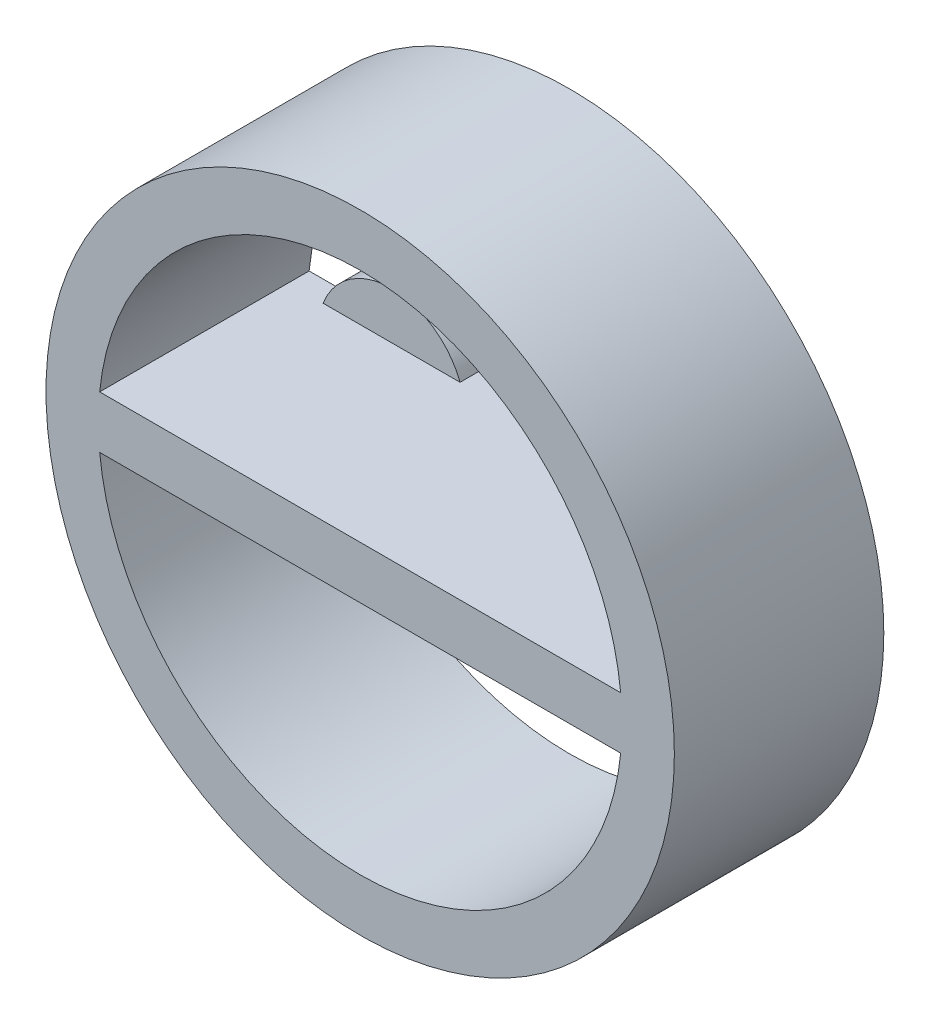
ISO-10303-21;
HEADER;
FILE_DESCRIPTION(('STEP AP214'),'2;1');
FILE_NAME('part.step','',(''),(''),'','','');
FILE_SCHEMA(('AUTOMOTIVE_DESIGN { 1 0 10303 214 1 1 1 1 }'));
ENDSEC;
DATA;
#1=APPLICATION_CONTEXT('core data for automotive mechanical design processes');
#2=APPLICATION_PROTOCOL_DEFINITION('international standard','automotive_design',2000,#1);
#3=PRODUCT_CONTEXT('',#1,'mechanical');
#4=PRODUCT('Part','Part','',(#3));
#5=PRODUCT_RELATED_PRODUCT_CATEGORY('part','',(#4));
#6=PRODUCT_DEFINITION_FORMATION('','',#4);
#7=PRODUCT_DEFINITION_CONTEXT('part definition',#1,'design');
#8=PRODUCT_DEFINITION('design','',#6,#7);
#9=PRODUCT_DEFINITION_SHAPE('','',#8);
#10=(LENGTH_UNIT() NAMED_UNIT(*) SI_UNIT(.MILLI.,.METRE.));
#11=(NAMED_UNIT(*) PLANE_ANGLE_UNIT() SI_UNIT($,.RADIAN.));
#12=(NAMED_UNIT(*) SI_UNIT($,.STERADIAN.) SOLID_ANGLE_UNIT());
#13=UNCERTAINTY_MEASURE_WITH_UNIT(LENGTH_MEASURE(1.E-05),#10,'distance_accuracy_value','');
#14=(GEOMETRIC_REPRESENTATION_CONTEXT(3) GLOBAL_UNCERTAINTY_ASSIGNED_CONTEXT((#13)) GLOBAL_UNIT_ASSIGNED_CONTEXT((#10,
#11,#12)) REPRESENTATION_CONTEXT('',''));
#15=CARTESIAN_POINT('',(0.,0.,0.));
#16=DIRECTION('',(0.,0.,1.));
#17=DIRECTION('',(1.,0.,0.));
#18=AXIS2_PLACEMENT_3D('',#15,#16,#17);
#19=CARTESIAN_POINT('',(-2.75,0.25,2.));
#20=DIRECTION('',(0.,-1.,0.));
#21=DIRECTION('',(0.,0.,-1.));
#22=AXIS2_PLACEMENT_3D('',#19,#20,#21);
#23=PLANE('',#22);
#24=DIRECTION('',(0.,0.,-1.));
#25=VECTOR('',#24,1.);
#26=CARTESIAN_POINT('',(-2.1538348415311,0.25,0.2));
#27=LINE('',#26,#25);
#28=CARTESIAN_POINT('',(-2.1538348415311,0.25,0.));
#29=VERTEX_POINT('',#28);
#30=CARTESIAN_POINT('',(-2.1538348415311,0.25,0.2));
#31=VERTEX_POINT('',#30);
#32=EDGE_CURVE('E130',#29,#31,#27,.F.);
#33=ORIENTED_EDGE('',*,*,#32,.F.);
#34=DIRECTION('',(-1.,0.,0.));
#35=VECTOR('',#34,1.);
#36=CARTESIAN_POINT('',(-2.75,0.25,0.));
#37=LINE('',#36,#35);
#38=CARTESIAN_POINT('',(-2.48746859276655,0.25,0.));
#39=VERTEX_POINT('',#38);
#40=EDGE_CURVE('E118',#29,#39,#37,.T.);
#41=ORIENTED_EDGE('',*,*,#40,.T.);
#42=DIRECTION('',(0.,0.,-1.));
#43=VECTOR('',#42,1.);
#44=CARTESIAN_POINT('',(-2.48746859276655,0.25,2.));
#45=LINE('',#44,#43);
#46=CARTESIAN_POINT('',(-2.48746859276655,0.25,2.));
#47=VERTEX_POINT('',#46);
#48=EDGE_CURVE('E198',#47,#39,#45,.T.);
#49=ORIENTED_EDGE('',*,*,#48,.F.);
#50=DIRECTION('',(-1.,0.,0.));
#51=VECTOR('',#50,1.);
#52=CARTESIAN_POINT('',(-2.75,0.25,2.));
#53=LINE('',#52,#51);
#54=CARTESIAN_POINT('',(2.48746859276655,0.25,2.));
#55=VERTEX_POINT('',#54);
#56=EDGE_CURVE('E167',#55,#47,#53,.T.);
#57=ORIENTED_EDGE('',*,*,#56,.F.);
#58=DIRECTION('',(0.,0.,-1.));
#59=VECTOR('',#58,1.);
#60=CARTESIAN_POINT('',(2.48746859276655,0.25,2.));
#61=LINE('',#60,#59);
#62=CARTESIAN_POINT('',(2.48746859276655,0.25,0.));
#63=VERTEX_POINT('',#62);
#64=EDGE_CURVE('E195',#63,#55,#61,.F.);
#65=ORIENTED_EDGE('',*,*,#64,.F.);
#66=CARTESIAN_POINT('',(2.1538348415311,0.25,0.));
#67=VERTEX_POINT('',#66);
#68=EDGE_CURVE('E129',#63,#67,#37,.T.);
#69=ORIENTED_EDGE('',*,*,#68,.T.);
#70=DIRECTION('',(0.,0.,-1.));
#71=VECTOR('',#70,1.);
#72=CARTESIAN_POINT('',(2.1538348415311,0.25,0.2));
#73=LINE('',#72,#71);
#74=CARTESIAN_POINT('',(2.1538348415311,0.25,0.2));
#75=VERTEX_POINT('',#74);
#76=EDGE_CURVE('E162',#75,#67,#73,.T.);
#77=ORIENTED_EDGE('',*,*,#76,.F.);
#78=DIRECTION('',(-1.,0.,0.));
#79=VECTOR('',#78,1.);
#80=CARTESIAN_POINT('',(-2.75,0.25,0.2));
#81=LINE('',#80,#79);
#82=CARTESIAN_POINT('',(0.846165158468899,0.25,0.2));
#83=VERTEX_POINT('',#82);
#84=EDGE_CURVE('E156',#75,#83,#81,.T.);
#85=ORIENTED_EDGE('',*,*,#84,.T.);
#86=DIRECTION('',(0.,0.,-1.));
#87=VECTOR('',#86,1.);
#88=CARTESIAN_POINT('',(0.846165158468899,0.25,0.2));
#89=LINE('',#88,#87);
#90=CARTESIAN_POINT('',(0.846165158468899,0.25,0.));
#91=VERTEX_POINT('',#90);
#92=EDGE_CURVE('E127',#91,#83,#89,.F.);
#93=ORIENTED_EDGE('',*,*,#92,.F.);
#94=CARTESIAN_POINT('',(-0.846165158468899,0.25,0.));
#95=VERTEX_POINT('',#94);
#96=EDGE_CURVE('E126',#91,#95,#37,.T.);
#97=ORIENTED_EDGE('',*,*,#96,.T.);
#98=DIRECTION('',(0.,0.,-1.));
#99=VECTOR('',#98,1.);
#100=CARTESIAN_POINT('',(-0.846165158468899,0.25,0.2));
#101=LINE('',#100,#99);
#102=CARTESIAN_POINT('',(-0.846165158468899,0.25,0.2));
#103=VERTEX_POINT('',#102);
#104=EDGE_CURVE('E51',#103,#95,#101,.T.);
#105=ORIENTED_EDGE('',*,*,#104,.F.);
#106=DIRECTION('',(-1.,0.,0.));
#107=VECTOR('',#106,1.);
#108=CARTESIAN_POINT('',(-2.75,0.25,0.2));
#109=LINE('',#108,#107);
#110=EDGE_CURVE('E46',#103,#31,#109,.T.);
#111=ORIENTED_EDGE('',*,*,#110,.T.);
#112=EDGE_LOOP('',(#33,#41,#49,#57,#65,#69,#77,#85,#93,#97,#105,#111));
#113=FACE_BOUND('',#112,.T.);
#114=ADVANCED_FACE('F31',(#113),#23,.F.);
#115=CARTESIAN_POINT('',(-2.75,-0.25,2.));
#116=DIRECTION('',(0.,1.,0.));
#117=DIRECTION('',(0.,0.,1.));
#118=AXIS2_PLACEMENT_3D('',#115,#116,#117);
#119=PLANE('',#118);
#120=DIRECTION('',(0.,0.,-1.));
#121=VECTOR('',#120,1.);
#122=CARTESIAN_POINT('',(-0.846165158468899,-0.25,0.2));
#123=LINE('',#122,#121);
#124=CARTESIAN_POINT('',(-0.846165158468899,-0.25,0.));
#125=VERTEX_POINT('',#124);
#126=CARTESIAN_POINT('',(-0.846165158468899,-0.25,0.2));
#127=VERTEX_POINT('',#126);
#128=EDGE_CURVE('E147',#125,#127,#123,.F.);
#129=ORIENTED_EDGE('',*,*,#128,.F.);
#130=DIRECTION('',(1.,0.,0.));
#131=VECTOR('',#130,1.);
#132=CARTESIAN_POINT('',(-2.75,-0.25,0.));
#133=LINE('',#132,#131);
#134=CARTESIAN_POINT('',(0.846165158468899,-0.25,0.));
#135=VERTEX_POINT('',#134);
#136=EDGE_CURVE('E177',#125,#135,#133,.T.);
#137=ORIENTED_EDGE('',*,*,#136,.T.);
#138=DIRECTION('',(0.,0.,-1.));
#139=VECTOR('',#138,1.);
#140=CARTESIAN_POINT('',(0.846165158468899,-0.25,0.2));
#141=LINE('',#140,#139);
#142=CARTESIAN_POINT('',(0.846165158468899,-0.25,0.2));
#143=VERTEX_POINT('',#142);
#144=EDGE_CURVE('E202',#143,#135,#141,.T.);
#145=ORIENTED_EDGE('',*,*,#144,.F.);
#146=DIRECTION('',(1.,0.,0.));
#147=VECTOR('',#146,1.);
#148=CARTESIAN_POINT('',(-2.75,-0.25,0.2));
#149=LINE('',#148,#147);
#150=CARTESIAN_POINT('',(2.1538348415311,-0.25,0.2));
#151=VERTEX_POINT('',#150);
#152=EDGE_CURVE('E200',#143,#151,#149,.T.);
#153=ORIENTED_EDGE('',*,*,#152,.T.);
#154=DIRECTION('',(0.,0.,-1.));
#155=VECTOR('',#154,1.);
#156=CARTESIAN_POINT('',(2.1538348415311,-0.25,0.2));
#157=LINE('',#156,#155);
#158=CARTESIAN_POINT('',(2.1538348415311,-0.25,0.));
#159=VERTEX_POINT('',#158);
#160=EDGE_CURVE('E39',#159,#151,#157,.F.);
#161=ORIENTED_EDGE('',*,*,#160,.F.);
#162=CARTESIAN_POINT('',(2.48746859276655,-0.25,0.));
#163=VERTEX_POINT('',#162);
#164=EDGE_CURVE('E175',#159,#163,#133,.T.);
#165=ORIENTED_EDGE('',*,*,#164,.T.);
#166=DIRECTION('',(0.,0.,-1.));
#167=VECTOR('',#166,1.);
#168=CARTESIAN_POINT('',(2.48746859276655,-0.25,2.));
#169=LINE('',#168,#167);
#170=CARTESIAN_POINT('',(2.48746859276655,-0.25,2.));
#171=VERTEX_POINT('',#170);
#172=EDGE_CURVE('E192',#171,#163,#169,.T.);
#173=ORIENTED_EDGE('',*,*,#172,.F.);
#174=DIRECTION('',(1.,0.,0.));
#175=VECTOR('',#174,1.);
#176=CARTESIAN_POINT('',(-2.75,-0.25,2.));
#177=LINE('',#176,#175);
#178=CARTESIAN_POINT('',(-2.48746859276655,-0.25,2.));
#179=VERTEX_POINT('',#178);
#180=EDGE_CURVE('E170',#179,#171,#177,.T.);
#181=ORIENTED_EDGE('',*,*,#180,.F.);
#182=DIRECTION('',(0.,0.,-1.));
#183=VECTOR('',#182,1.);
#184=CARTESIAN_POINT('',(-2.48746859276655,-0.25,2.));
#185=LINE('',#184,#183);
#186=CARTESIAN_POINT('',(-2.48746859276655,-0.25,0.));
#187=VERTEX_POINT('',#186);
#188=EDGE_CURVE('E187',#187,#179,#185,.F.);
#189=ORIENTED_EDGE('',*,*,#188,.F.);
#190=CARTESIAN_POINT('',(-2.1538348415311,-0.25,0.));
#191=VERTEX_POINT('',#190);
#192=EDGE_CURVE('E171',#187,#191,#133,.T.);
#193=ORIENTED_EDGE('',*,*,#192,.T.);
#194=DIRECTION('',(0.,0.,-1.));
#195=VECTOR('',#194,1.);
#196=CARTESIAN_POINT('',(-2.1538348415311,-0.25,0.2));
#197=LINE('',#196,#195);
#198=CARTESIAN_POINT('',(-2.1538348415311,-0.25,0.2));
#199=VERTEX_POINT('',#198);
#200=EDGE_CURVE('E144',#199,#191,#197,.T.);
#201=ORIENTED_EDGE('',*,*,#200,.F.);
#202=DIRECTION('',(1.,0.,0.));
#203=VECTOR('',#202,1.);
#204=CARTESIAN_POINT('',(-2.75,-0.25,0.2));
#205=LINE('',#204,#203);
#206=EDGE_CURVE('E11',#199,#127,#205,.T.);
#207=ORIENTED_EDGE('',*,*,#206,.T.);
#208=EDGE_LOOP('',(#129,#137,#145,#153,#161,#165,#173,#181,#189,#193,#201,#207));
#209=FACE_BOUND('',#208,.T.);
#210=ADVANCED_FACE('F217',(#209),#119,.F.);
#211=CARTESIAN_POINT('',(0.,0.,2.));
#212=DIRECTION('',(0.,0.,-1.));
#213=DIRECTION('',(-1.,0.,0.));
#214=AXIS2_PLACEMENT_3D('',#211,#212,#213);
#215=CYLINDRICAL_SURFACE('',#214,2.5);
#216=CARTESIAN_POINT('',(0.,0.,2.));
#217=DIRECTION('',(0.,0.,1.));
#218=DIRECTION('',(1.,0.,0.));
#219=AXIS2_PLACEMENT_3D('',#216,#217,#218);
#220=CIRCLE('',#219,2.5);
#221=EDGE_CURVE('E178',#55,#47,#220,.T.);
#222=ORIENTED_EDGE('',*,*,#221,.T.);
#223=ORIENTED_EDGE('',*,*,#48,.T.);
#224=CARTESIAN_POINT('',(0.,0.,0.));
#225=DIRECTION('',(0.,0.,1.));
#226=DIRECTION('',(1.,0.,0.));
#227=AXIS2_PLACEMENT_3D('',#224,#225,#226);
#228=CIRCLE('',#227,2.5);
#229=EDGE_CURVE('E124',#63,#39,#228,.T.);
#230=ORIENTED_EDGE('',*,*,#229,.F.);
#231=ORIENTED_EDGE('',*,*,#64,.T.);
#232=EDGE_LOOP('',(#222,#223,#230,#231));
#233=FACE_BOUND('',#232,.T.);
#234=ADVANCED_FACE('F255',(#233),#215,.F.);
#235=EDGE_CURVE('E182',#179,#171,#220,.T.);
#236=ORIENTED_EDGE('',*,*,#235,.T.);
#237=ORIENTED_EDGE('',*,*,#172,.T.);
#238=EDGE_CURVE('E173',#187,#163,#228,.T.);
#239=ORIENTED_EDGE('',*,*,#238,.F.);
#240=ORIENTED_EDGE('',*,*,#188,.T.);
#241=EDGE_LOOP('',(#236,#237,#239,#240));
#242=FACE_BOUND('',#241,.T.);
#243=ADVANCED_FACE('F224',(#242),#215,.F.);
#244=CARTESIAN_POINT('',(0.,0.,2.));
#245=DIRECTION('',(0.,0.,1.));
#246=DIRECTION('',(1.,0.,0.));
#247=AXIS2_PLACEMENT_3D('',#244,#245,#246);
#248=PLANE('',#247);
#249=ORIENTED_EDGE('',*,*,#56,.T.);
#250=ORIENTED_EDGE('',*,*,#221,.F.);
#251=EDGE_LOOP('',(#249,#250));
#252=FACE_BOUND('',#251,.T.);
#253=ORIENTED_EDGE('',*,*,#180,.T.);
#254=ORIENTED_EDGE('',*,*,#235,.F.);
#255=EDGE_LOOP('',(#253,#254));
#256=FACE_BOUND('',#255,.T.);
#257=CARTESIAN_POINT('',(0.,0.,2.));
#258=DIRECTION('',(0.,0.,1.));
#259=DIRECTION('',(1.,0.,0.));
#260=AXIS2_PLACEMENT_3D('',#257,#258,#259);
#261=CIRCLE('',#260,3.);
#262=CARTESIAN_POINT('',(3.,0.,2.));
#263=VERTEX_POINT('',#262);
#264=EDGE_CURVE('E184',#263,#263,#261,.T.);
#265=ORIENTED_EDGE('',*,*,#264,.T.);
#266=EDGE_LOOP('',(#265));
#267=FACE_BOUND('',#266,.T.);
#268=ADVANCED_FACE('F228',(#252,#256,#267),#248,.T.);
#269=CARTESIAN_POINT('',(0.,0.,0.));
#270=DIRECTION('',(0.,0.,1.));
#271=DIRECTION('',(1.,0.,0.));
#272=AXIS2_PLACEMENT_3D('',#269,#270,#271);
#273=PLANE('',#272);
#274=ORIENTED_EDGE('',*,*,#40,.F.);
#275=CARTESIAN_POINT('',(-1.5,0.,0.));
#276=DIRECTION('',(0.,0.,1.));
#277=DIRECTION('',(1.,0.,0.));
#278=AXIS2_PLACEMENT_3D('',#275,#276,#277);
#279=CIRCLE('',#278,0.7);
#280=EDGE_CURVE('E122',#95,#29,#279,.T.);
#281=ORIENTED_EDGE('',*,*,#280,.F.);
#282=ORIENTED_EDGE('',*,*,#96,.F.);
#283=CARTESIAN_POINT('',(1.5,0.,0.));
#284=DIRECTION('',(0.,0.,1.));
#285=DIRECTION('',(1.,0.,0.));
#286=AXIS2_PLACEMENT_3D('',#283,#284,#285);
#287=CIRCLE('',#286,0.7);
#288=EDGE_CURVE('E158',#67,#91,#287,.T.);
#289=ORIENTED_EDGE('',*,*,#288,.F.);
#290=ORIENTED_EDGE('',*,*,#68,.F.);
#291=ORIENTED_EDGE('',*,*,#229,.T.);
#292=EDGE_LOOP('',(#274,#281,#282,#289,#290,#291));
#293=FACE_BOUND('',#292,.T.);
#294=ORIENTED_EDGE('',*,*,#136,.F.);
#295=EDGE_CURVE('E137',#191,#125,#279,.T.);
#296=ORIENTED_EDGE('',*,*,#295,.F.);
#297=ORIENTED_EDGE('',*,*,#192,.F.);
#298=ORIENTED_EDGE('',*,*,#238,.T.);
#299=ORIENTED_EDGE('',*,*,#164,.F.);
#300=EDGE_CURVE('E152',#135,#159,#287,.T.);
#301=ORIENTED_EDGE('',*,*,#300,.F.);
#302=EDGE_LOOP('',(#294,#296,#297,#298,#299,#301));
#303=FACE_BOUND('',#302,.T.);
#304=CARTESIAN_POINT('',(0.,0.,0.));
#305=DIRECTION('',(0.,0.,1.));
#306=DIRECTION('',(1.,0.,0.));
#307=AXIS2_PLACEMENT_3D('',#304,#305,#306);
#308=CIRCLE('',#307,3.);
#309=CARTESIAN_POINT('',(3.,0.,0.));
#310=VERTEX_POINT('',#309);
#311=EDGE_CURVE('E181',#310,#310,#308,.T.);
#312=ORIENTED_EDGE('',*,*,#311,.F.);
#313=EDGE_LOOP('',(#312));
#314=FACE_BOUND('',#313,.T.);
#315=ADVANCED_FACE('F119',(#293,#303,#314),#273,.F.);
#316=CARTESIAN_POINT('',(0.,0.,2.));
#317=DIRECTION('',(0.,0.,-1.));
#318=DIRECTION('',(-1.,0.,0.));
#319=AXIS2_PLACEMENT_3D('',#316,#317,#318);
#320=CYLINDRICAL_SURFACE('',#319,3.);
#321=ORIENTED_EDGE('',*,*,#264,.F.);
#322=EDGE_LOOP('',(#321));
#323=FACE_BOUND('',#322,.T.);
#324=ORIENTED_EDGE('',*,*,#311,.T.);
#325=EDGE_LOOP('',(#324));
#326=FACE_BOUND('',#325,.T.);
#327=ADVANCED_FACE('F33',(#323,#326),#320,.T.);
#328=CARTESIAN_POINT('',(1.5,0.,0.2));
#329=DIRECTION('',(0.,0.,1.));
#330=DIRECTION('',(1.,0.,0.));
#331=AXIS2_PLACEMENT_3D('',#328,#329,#330);
#332=PLANE('',#331);
#333=ORIENTED_EDGE('',*,*,#152,.F.);
#334=CARTESIAN_POINT('',(1.5,0.,0.2));
#335=DIRECTION('',(0.,0.,1.));
#336=DIRECTION('',(1.,0.,0.));
#337=AXIS2_PLACEMENT_3D('',#334,#335,#336);
#338=CIRCLE('',#337,0.7);
#339=EDGE_CURVE('E157',#143,#151,#338,.T.);
#340=ORIENTED_EDGE('',*,*,#339,.T.);
#341=EDGE_LOOP('',(#333,#340));
#342=FACE_BOUND('',#341,.T.);
#343=ADVANCED_FACE('F215',(#342),#332,.T.);
#344=CARTESIAN_POINT('',(1.5,0.,0.2));
#345=DIRECTION('',(0.,0.,-1.));
#346=DIRECTION('',(-1.,0.,0.));
#347=AXIS2_PLACEMENT_3D('',#344,#345,#346);
#348=CYLINDRICAL_SURFACE('',#347,0.7);
#349=ORIENTED_EDGE('',*,*,#300,.T.);
#350=ORIENTED_EDGE('',*,*,#160,.T.);
#351=ORIENTED_EDGE('',*,*,#339,.F.);
#352=ORIENTED_EDGE('',*,*,#144,.T.);
#353=EDGE_LOOP('',(#349,#350,#351,#352));
#354=FACE_BOUND('',#353,.T.);
#355=ADVANCED_FACE('F210',(#354),#348,.T.);
#356=ORIENTED_EDGE('',*,*,#288,.T.);
#357=ORIENTED_EDGE('',*,*,#92,.T.);
#358=EDGE_CURVE('E153',#75,#83,#338,.T.);
#359=ORIENTED_EDGE('',*,*,#358,.F.);
#360=ORIENTED_EDGE('',*,*,#76,.T.);
#361=EDGE_LOOP('',(#356,#357,#359,#360));
#362=FACE_BOUND('',#361,.T.);
#363=ADVANCED_FACE('F245',(#362),#348,.T.);
#364=ORIENTED_EDGE('',*,*,#84,.F.);
#365=ORIENTED_EDGE('',*,*,#358,.T.);
#366=EDGE_LOOP('',(#364,#365));
#367=FACE_BOUND('',#366,.T.);
#368=ADVANCED_FACE('F237',(#367),#332,.T.);
#369=CARTESIAN_POINT('',(-1.5,0.,0.2));
#370=DIRECTION('',(0.,0.,1.));
#371=DIRECTION('',(1.,0.,0.));
#372=AXIS2_PLACEMENT_3D('',#369,#370,#371);
#373=PLANE('',#372);
#374=ORIENTED_EDGE('',*,*,#206,.F.);
#375=CARTESIAN_POINT('',(-1.5,0.,0.2));
#376=DIRECTION('',(0.,0.,1.));
#377=DIRECTION('',(1.,0.,0.));
#378=AXIS2_PLACEMENT_3D('',#375,#376,#377);
#379=CIRCLE('',#378,0.7);
#380=EDGE_CURVE('E136',#199,#127,#379,.T.);
#381=ORIENTED_EDGE('',*,*,#380,.T.);
#382=EDGE_LOOP('',(#374,#381));
#383=FACE_BOUND('',#382,.T.);
#384=ADVANCED_FACE('F235',(#383),#373,.T.);
#385=CARTESIAN_POINT('',(-1.5,0.,0.2));
#386=DIRECTION('',(0.,0.,-1.));
#387=DIRECTION('',(-1.,0.,0.));
#388=AXIS2_PLACEMENT_3D('',#385,#386,#387);
#389=CYLINDRICAL_SURFACE('',#388,0.7);
#390=ORIENTED_EDGE('',*,*,#295,.T.);
#391=ORIENTED_EDGE('',*,*,#128,.T.);
#392=ORIENTED_EDGE('',*,*,#380,.F.);
#393=ORIENTED_EDGE('',*,*,#200,.T.);
#394=EDGE_LOOP('',(#390,#391,#392,#393));
#395=FACE_BOUND('',#394,.T.);
#396=ADVANCED_FACE('F233',(#395),#389,.T.);
#397=ORIENTED_EDGE('',*,*,#110,.F.);
#398=EDGE_CURVE('E140',#103,#31,#379,.T.);
#399=ORIENTED_EDGE('',*,*,#398,.T.);
#400=EDGE_LOOP('',(#397,#399));
#401=FACE_BOUND('',#400,.T.);
#402=ADVANCED_FACE('F239',(#401),#373,.T.);
#403=ORIENTED_EDGE('',*,*,#280,.T.);
#404=ORIENTED_EDGE('',*,*,#32,.T.);
#405=ORIENTED_EDGE('',*,*,#398,.F.);
#406=ORIENTED_EDGE('',*,*,#104,.T.);
#407=EDGE_LOOP('',(#403,#404,#405,#406));
#408=FACE_BOUND('',#407,.T.);
#409=ADVANCED_FACE('F135',(#408),#389,.T.);
#410=CLOSED_SHELL('',(#114,#210,#234,#243,#268,#315,#327,#343,#355,#363,#368,#384,#396,#402,#409));
#411=MANIFOLD_SOLID_BREP('B2',#410);
#412=ADVANCED_BREP_SHAPE_REPRESENTATION('',(#18,#411),#14);
#413=SHAPE_DEFINITION_REPRESENTATION(#9,#412);
ENDSEC;
END-ISO-10303-21;
